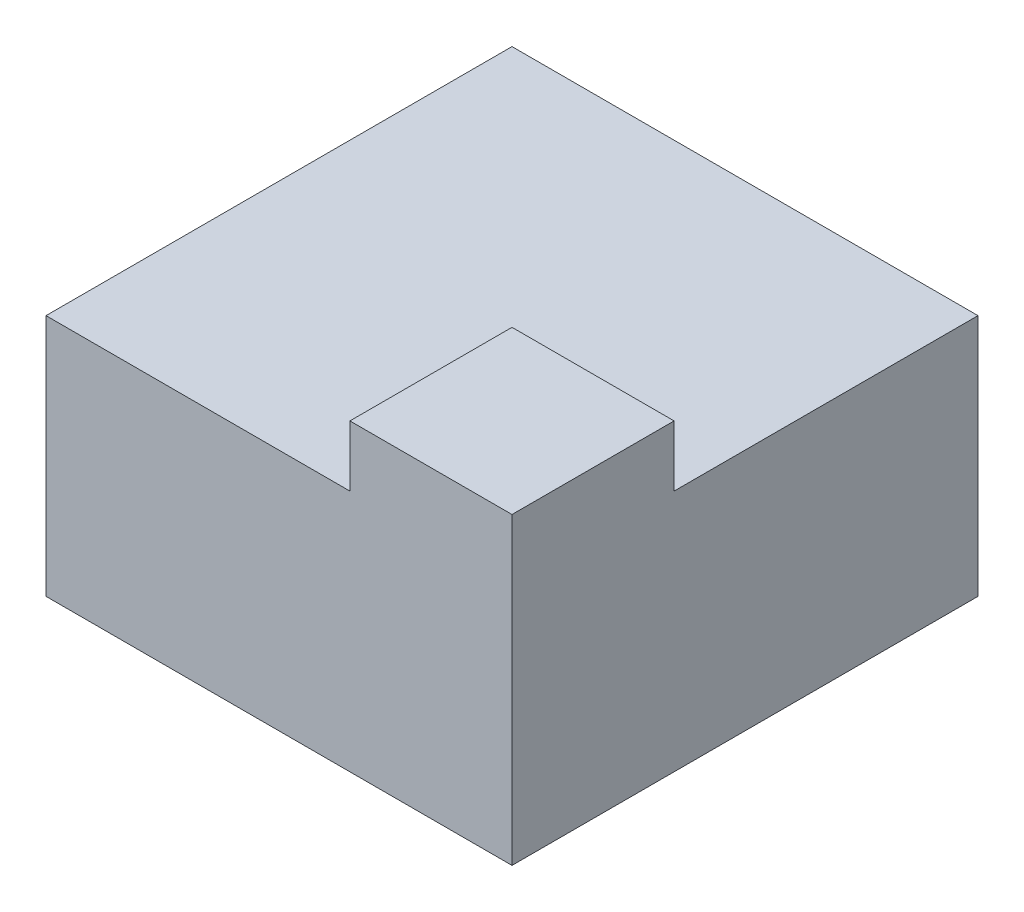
ISO-10303-21;
HEADER;
FILE_DESCRIPTION(('STEP AP214'),'2;1');
FILE_NAME('part.step','',(''),(''),'','','');
FILE_SCHEMA(('AUTOMOTIVE_DESIGN { 1 0 10303 214 1 1 1 1 }'));
ENDSEC;
DATA;
#1=APPLICATION_CONTEXT('core data for automotive mechanical design processes');
#2=APPLICATION_PROTOCOL_DEFINITION('international standard','automotive_design',2000,#1);
#3=PRODUCT_CONTEXT('',#1,'mechanical');
#4=PRODUCT('Part','Part','',(#3));
#5=PRODUCT_RELATED_PRODUCT_CATEGORY('part','',(#4));
#6=PRODUCT_DEFINITION_FORMATION('','',#4);
#7=PRODUCT_DEFINITION_CONTEXT('part definition',#1,'design');
#8=PRODUCT_DEFINITION('design','',#6,#7);
#9=PRODUCT_DEFINITION_SHAPE('','',#8);
#10=(LENGTH_UNIT() NAMED_UNIT(*) SI_UNIT(.MILLI.,.METRE.));
#11=(NAMED_UNIT(*) PLANE_ANGLE_UNIT() SI_UNIT($,.RADIAN.));
#12=(NAMED_UNIT(*) SI_UNIT($,.STERADIAN.) SOLID_ANGLE_UNIT());
#13=UNCERTAINTY_MEASURE_WITH_UNIT(LENGTH_MEASURE(1.E-05),#10,'distance_accuracy_value','');
#14=(GEOMETRIC_REPRESENTATION_CONTEXT(3) GLOBAL_UNCERTAINTY_ASSIGNED_CONTEXT((#13)) GLOBAL_UNIT_ASSIGNED_CONTEXT((#10,
#11,#12)) REPRESENTATION_CONTEXT('',''));
#15=CARTESIAN_POINT('',(0.,0.,0.));
#16=DIRECTION('',(0.,0.,1.));
#17=DIRECTION('',(1.,0.,0.));
#18=AXIS2_PLACEMENT_3D('',#15,#16,#17);
#19=CARTESIAN_POINT('',(-115.,37.5,-57.5));
#20=DIRECTION('',(0.,0.,1.));
#21=DIRECTION('',(1.,0.,0.));
#22=AXIS2_PLACEMENT_3D('',#19,#20,#21);
#23=PLANE('',#22);
#24=DIRECTION('',(0.,1.,0.));
#25=VECTOR('',#24,1.);
#26=CARTESIAN_POINT('',(0.,22.5,-57.5));
#27=LINE('',#26,#25);
#28=CARTESIAN_POINT('',(0.,-37.5,-57.5));
#29=VERTEX_POINT('',#28);
#30=CARTESIAN_POINT('',(0.,22.5,-57.5));
#31=VERTEX_POINT('',#30);
#32=EDGE_CURVE('E117',#29,#31,#27,.T.);
#33=ORIENTED_EDGE('',*,*,#32,.F.);
#34=DIRECTION('',(-1.,0.,0.));
#35=VECTOR('',#34,1.);
#36=CARTESIAN_POINT('',(-115.,-37.5,-57.5));
#37=LINE('',#36,#35);
#38=CARTESIAN_POINT('',(-115.,-37.5,-57.5));
#39=VERTEX_POINT('',#38);
#40=EDGE_CURVE('E115',#29,#39,#37,.T.);
#41=ORIENTED_EDGE('',*,*,#40,.T.);
#42=DIRECTION('',(0.,-1.,0.));
#43=VECTOR('',#42,1.);
#44=CARTESIAN_POINT('',(-115.,37.5,-57.5));
#45=LINE('',#44,#43);
#46=CARTESIAN_POINT('',(-115.,22.5,-57.5));
#47=VERTEX_POINT('',#46);
#48=EDGE_CURVE('E11',#47,#39,#45,.T.);
#49=ORIENTED_EDGE('',*,*,#48,.F.);
#50=DIRECTION('',(-1.,0.,0.));
#51=VECTOR('',#50,1.);
#52=CARTESIAN_POINT('',(-115.,22.5,-57.5));
#53=LINE('',#52,#51);
#54=EDGE_CURVE('E137',#31,#47,#53,.T.);
#55=ORIENTED_EDGE('',*,*,#54,.F.);
#56=EDGE_LOOP('',(#33,#41,#49,#55));
#57=FACE_BOUND('',#56,.T.);
#58=ADVANCED_FACE('F38',(#57),#23,.F.);
#59=CARTESIAN_POINT('',(-115.,37.5,57.5));
#60=DIRECTION('',(0.,0.,-1.));
#61=DIRECTION('',(-1.,0.,0.));
#62=AXIS2_PLACEMENT_3D('',#59,#60,#61);
#63=PLANE('',#62);
#64=DIRECTION('',(0.,-1.,0.));
#65=VECTOR('',#64,1.);
#66=CARTESIAN_POINT('',(0.,37.5,57.5));
#67=LINE('',#66,#65);
#68=CARTESIAN_POINT('',(0.,37.5,57.5));
#69=VERTEX_POINT('',#68);
#70=CARTESIAN_POINT('',(0.,-37.5,57.5));
#71=VERTEX_POINT('',#70);
#72=EDGE_CURVE('E96',#69,#71,#67,.T.);
#73=ORIENTED_EDGE('',*,*,#72,.F.);
#74=DIRECTION('',(1.,0.,0.));
#75=VECTOR('',#74,1.);
#76=CARTESIAN_POINT('',(-115.,37.5,57.5));
#77=LINE('',#76,#75);
#78=CARTESIAN_POINT('',(-40.,37.5,57.5));
#79=VERTEX_POINT('',#78);
#80=EDGE_CURVE('E124',#79,#69,#77,.T.);
#81=ORIENTED_EDGE('',*,*,#80,.F.);
#82=DIRECTION('',(0.,1.,0.));
#83=VECTOR('',#82,1.);
#84=CARTESIAN_POINT('',(-40.,22.5,57.5));
#85=LINE('',#84,#83);
#86=CARTESIAN_POINT('',(-40.,22.5,57.5));
#87=VERTEX_POINT('',#86);
#88=EDGE_CURVE('E61',#87,#79,#85,.T.);
#89=ORIENTED_EDGE('',*,*,#88,.F.);
#90=DIRECTION('',(1.,0.,0.));
#91=VECTOR('',#90,1.);
#92=CARTESIAN_POINT('',(-115.,22.5,57.5));
#93=LINE('',#92,#91);
#94=CARTESIAN_POINT('',(-115.,22.5,57.5));
#95=VERTEX_POINT('',#94);
#96=EDGE_CURVE('E149',#95,#87,#93,.T.);
#97=ORIENTED_EDGE('',*,*,#96,.F.);
#98=DIRECTION('',(0.,-1.,0.));
#99=VECTOR('',#98,1.);
#100=CARTESIAN_POINT('',(-115.,37.5,57.5));
#101=LINE('',#100,#99);
#102=CARTESIAN_POINT('',(-115.,-37.5,57.5));
#103=VERTEX_POINT('',#102);
#104=EDGE_CURVE('E46',#95,#103,#101,.T.);
#105=ORIENTED_EDGE('',*,*,#104,.T.);
#106=DIRECTION('',(1.,0.,0.));
#107=VECTOR('',#106,1.);
#108=CARTESIAN_POINT('',(-115.,-37.5,57.5));
#109=LINE('',#108,#107);
#110=EDGE_CURVE('E114',#103,#71,#109,.T.);
#111=ORIENTED_EDGE('',*,*,#110,.T.);
#112=EDGE_LOOP('',(#73,#81,#89,#97,#105,#111));
#113=FACE_BOUND('',#112,.T.);
#114=ADVANCED_FACE('F119',(#113),#63,.F.);
#115=CARTESIAN_POINT('',(0.,37.5,0.));
#116=DIRECTION('',(0.,1.,0.));
#117=DIRECTION('',(0.,0.,1.));
#118=AXIS2_PLACEMENT_3D('',#115,#116,#117);
#119=PLANE('',#118);
#120=ORIENTED_EDGE('',*,*,#80,.T.);
#121=DIRECTION('',(0.,0.,1.));
#122=VECTOR('',#121,1.);
#123=CARTESIAN_POINT('',(0.,37.5,57.5));
#124=LINE('',#123,#122);
#125=CARTESIAN_POINT('',(0.,37.5,17.5));
#126=VERTEX_POINT('',#125);
#127=EDGE_CURVE('E102',#126,#69,#124,.T.);
#128=ORIENTED_EDGE('',*,*,#127,.F.);
#129=DIRECTION('',(1.,0.,0.));
#130=VECTOR('',#129,1.);
#131=CARTESIAN_POINT('',(-40.,37.5,17.5));
#132=LINE('',#131,#130);
#133=CARTESIAN_POINT('',(-40.,37.5,17.5));
#134=VERTEX_POINT('',#133);
#135=EDGE_CURVE('E158',#134,#126,#132,.T.);
#136=ORIENTED_EDGE('',*,*,#135,.F.);
#137=DIRECTION('',(0.,0.,-1.));
#138=VECTOR('',#137,1.);
#139=CARTESIAN_POINT('',(-40.,37.5,-57.5));
#140=LINE('',#139,#138);
#141=EDGE_CURVE('E138',#79,#134,#140,.T.);
#142=ORIENTED_EDGE('',*,*,#141,.F.);
#143=EDGE_LOOP('',(#120,#128,#136,#142));
#144=FACE_BOUND('',#143,.T.);
#145=ADVANCED_FACE('F182',(#144),#119,.T.);
#146=CARTESIAN_POINT('',(0.,-37.5,0.));
#147=DIRECTION('',(0.,1.,0.));
#148=DIRECTION('',(0.,0.,1.));
#149=AXIS2_PLACEMENT_3D('',#146,#147,#148);
#150=PLANE('',#149);
#151=DIRECTION('',(0.,0.,-1.));
#152=VECTOR('',#151,1.);
#153=CARTESIAN_POINT('',(0.,-37.5,57.5));
#154=LINE('',#153,#152);
#155=EDGE_CURVE('E99',#71,#29,#154,.T.);
#156=ORIENTED_EDGE('',*,*,#155,.F.);
#157=ORIENTED_EDGE('',*,*,#110,.F.);
#158=DIRECTION('',(0.,0.,1.));
#159=VECTOR('',#158,1.);
#160=CARTESIAN_POINT('',(-115.,-37.5,-57.5));
#161=LINE('',#160,#159);
#162=EDGE_CURVE('E125',#39,#103,#161,.T.);
#163=ORIENTED_EDGE('',*,*,#162,.F.);
#164=ORIENTED_EDGE('',*,*,#40,.F.);
#165=EDGE_LOOP('',(#156,#157,#163,#164));
#166=FACE_BOUND('',#165,.T.);
#167=ADVANCED_FACE('F112',(#166),#150,.F.);
#168=CARTESIAN_POINT('',(0.,22.5,0.));
#169=DIRECTION('',(0.,1.,0.));
#170=DIRECTION('',(0.,0.,1.));
#171=AXIS2_PLACEMENT_3D('',#168,#169,#170);
#172=PLANE('',#171);
#173=DIRECTION('',(1.,0.,0.));
#174=VECTOR('',#173,1.);
#175=CARTESIAN_POINT('',(-40.,22.5,17.5));
#176=LINE('',#175,#174);
#177=CARTESIAN_POINT('',(-40.,22.5,17.5));
#178=VERTEX_POINT('',#177);
#179=CARTESIAN_POINT('',(0.,22.5,17.5));
#180=VERTEX_POINT('',#179);
#181=EDGE_CURVE('E157',#178,#180,#176,.T.);
#182=ORIENTED_EDGE('',*,*,#181,.T.);
#183=DIRECTION('',(0.,0.,1.));
#184=VECTOR('',#183,1.);
#185=CARTESIAN_POINT('',(0.,22.5,17.5));
#186=LINE('',#185,#184);
#187=EDGE_CURVE('E53',#31,#180,#186,.T.);
#188=ORIENTED_EDGE('',*,*,#187,.F.);
#189=ORIENTED_EDGE('',*,*,#54,.T.);
#190=DIRECTION('',(0.,0.,1.));
#191=VECTOR('',#190,1.);
#192=CARTESIAN_POINT('',(-115.,22.5,-57.5));
#193=LINE('',#192,#191);
#194=EDGE_CURVE('E141',#47,#95,#193,.T.);
#195=ORIENTED_EDGE('',*,*,#194,.T.);
#196=ORIENTED_EDGE('',*,*,#96,.T.);
#197=DIRECTION('',(0.,0.,-1.));
#198=VECTOR('',#197,1.);
#199=CARTESIAN_POINT('',(-40.,22.5,-57.5));
#200=LINE('',#199,#198);
#201=EDGE_CURVE('E145',#87,#178,#200,.T.);
#202=ORIENTED_EDGE('',*,*,#201,.T.);
#203=EDGE_LOOP('',(#182,#188,#189,#195,#196,#202));
#204=FACE_BOUND('',#203,.T.);
#205=ADVANCED_FACE('F176',(#204),#172,.T.);
#206=CARTESIAN_POINT('',(-40.,22.5,17.5));
#207=DIRECTION('',(0.,0.,1.));
#208=DIRECTION('',(1.,0.,0.));
#209=AXIS2_PLACEMENT_3D('',#206,#207,#208);
#210=PLANE('',#209);
#211=DIRECTION('',(0.,1.,0.));
#212=VECTOR('',#211,1.);
#213=CARTESIAN_POINT('',(0.,22.5,17.5));
#214=LINE('',#213,#212);
#215=EDGE_CURVE('E167',#180,#126,#214,.T.);
#216=ORIENTED_EDGE('',*,*,#215,.F.);
#217=ORIENTED_EDGE('',*,*,#181,.F.);
#218=DIRECTION('',(0.,1.,0.));
#219=VECTOR('',#218,1.);
#220=CARTESIAN_POINT('',(-40.,22.5,17.5));
#221=LINE('',#220,#219);
#222=EDGE_CURVE('E142',#178,#134,#221,.T.);
#223=ORIENTED_EDGE('',*,*,#222,.T.);
#224=ORIENTED_EDGE('',*,*,#135,.T.);
#225=EDGE_LOOP('',(#216,#217,#223,#224));
#226=FACE_BOUND('',#225,.T.);
#227=ADVANCED_FACE('F187',(#226),#210,.F.);
#228=CARTESIAN_POINT('',(-115.,37.5,-57.5));
#229=DIRECTION('',(1.,0.,0.));
#230=DIRECTION('',(0.,0.,-1.));
#231=AXIS2_PLACEMENT_3D('',#228,#229,#230);
#232=PLANE('',#231);
#233=ORIENTED_EDGE('',*,*,#194,.F.);
#234=ORIENTED_EDGE('',*,*,#48,.T.);
#235=ORIENTED_EDGE('',*,*,#162,.T.);
#236=ORIENTED_EDGE('',*,*,#104,.F.);
#237=EDGE_LOOP('',(#233,#234,#235,#236));
#238=FACE_BOUND('',#237,.T.);
#239=ADVANCED_FACE('F180',(#238),#232,.F.);
#240=CARTESIAN_POINT('',(-40.,22.5,-57.5));
#241=DIRECTION('',(1.,0.,0.));
#242=DIRECTION('',(0.,0.,-1.));
#243=AXIS2_PLACEMENT_3D('',#240,#241,#242);
#244=PLANE('',#243);
#245=ORIENTED_EDGE('',*,*,#141,.T.);
#246=ORIENTED_EDGE('',*,*,#222,.F.);
#247=ORIENTED_EDGE('',*,*,#201,.F.);
#248=ORIENTED_EDGE('',*,*,#88,.T.);
#249=EDGE_LOOP('',(#245,#246,#247,#248));
#250=FACE_BOUND('',#249,.T.);
#251=ADVANCED_FACE('F185',(#250),#244,.F.);
#252=CARTESIAN_POINT('',(0.,0.,0.));
#253=DIRECTION('',(1.,0.,0.));
#254=DIRECTION('',(0.,0.,-1.));
#255=AXIS2_PLACEMENT_3D('',#252,#253,#254);
#256=PLANE('',#255);
#257=ORIENTED_EDGE('',*,*,#72,.T.);
#258=ORIENTED_EDGE('',*,*,#155,.T.);
#259=ORIENTED_EDGE('',*,*,#32,.T.);
#260=ORIENTED_EDGE('',*,*,#187,.T.);
#261=ORIENTED_EDGE('',*,*,#215,.T.);
#262=ORIENTED_EDGE('',*,*,#127,.T.);
#263=EDGE_LOOP('',(#257,#258,#259,#260,#261,#262));
#264=FACE_BOUND('',#263,.T.);
#265=ADVANCED_FACE('F98',(#264),#256,.T.);
#266=CLOSED_SHELL('',(#58,#114,#145,#167,#205,#227,#239,#251,#265));
#267=MANIFOLD_SOLID_BREP('B2',#266);
#268=ADVANCED_BREP_SHAPE_REPRESENTATION('',(#18,#267),#14);
#269=SHAPE_DEFINITION_REPRESENTATION(#9,#268);
ENDSEC;
END-ISO-10303-21;
